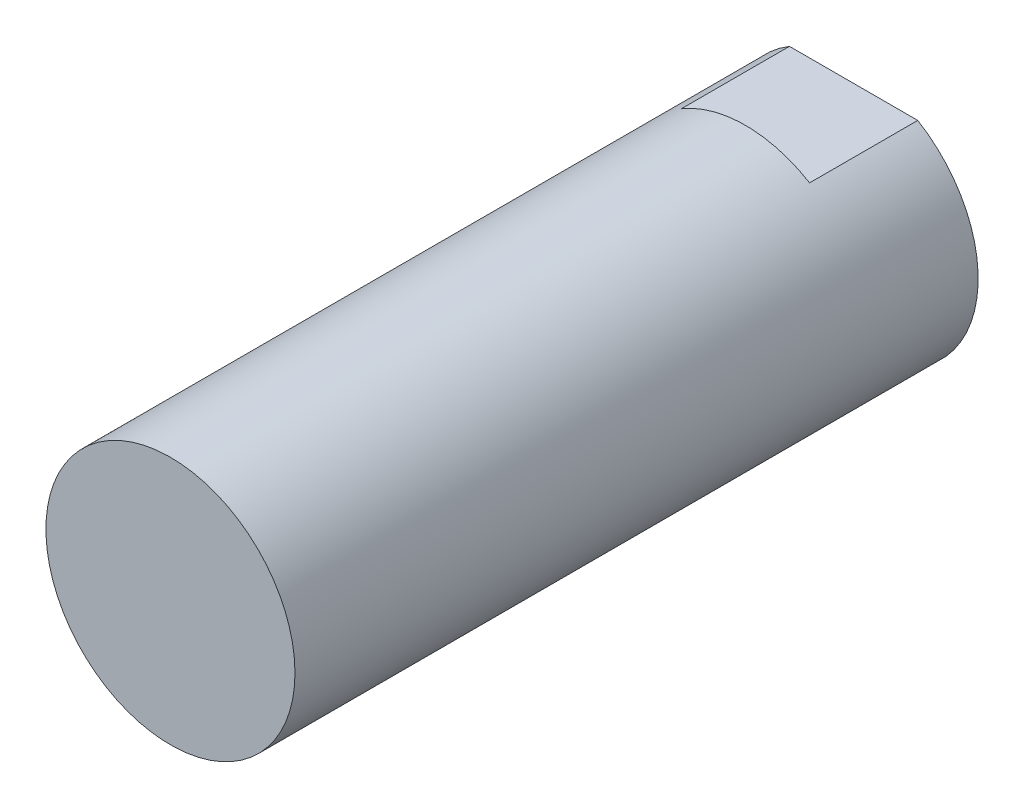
from build123d import *

# Parameters (mm, degrees)
SKETCH1_R          = 11.1125
EXTRUDE1_DEPTH     = 22.86
SKETCH2_R          = 5.55625
CUT_EXTRUDE1_DEPTH = 10.922
SKETCH3_R          = 3.96875
CUT_EXTRUDE2_DEPTH = 28.740852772
CHAMFER1_SIZE      = 1.016
CHAMFER1_SIZE2     = 1.75976362
SKETCH4_OUTSIDE_W  = 31.996
SKETCH4_OUTSIDE_H  = 31.996
CUT_EXTRUDE3_DEPTH = 9.652
SKETCH5_R          = 11.1125
EXTRUDE2_DEPTH     = 38.1


with BuildPart() as part:
    # Sketch1 → Extrude1 (new body)
    with BuildSketch(Plane.XY):
        Circle(SKETCH1_R)
    extrude(amount=EXTRUDE1_DEPTH)

    # Sketch2 → Cut-Extrude1 (cut)
    with BuildSketch(Plane.XY.offset(22.86)):
        Circle(SKETCH2_R)
    extrude(amount=-CUT_EXTRUDE1_DEPTH, mode=Mode.SUBTRACT)

    # Sketch3 → Cut-Extrude2 (cut, through all)
    with BuildSketch(Plane(origin=(0, 0, 0), x_dir=(-1, 0, 0), z_dir=(0, 0, -1))):
        Circle(SKETCH3_R)
    extrude(amount=-CUT_EXTRUDE2_DEPTH, mode=Mode.SUBTRACT)

    # Chamfer1
    chamfer1_edges = [part.edges().sort_by_distance(p)[0] for p in [
        (-5.55625, 0, 22.86),
    ]]
    chamfer1_side = [part.faces().sort_by_distance(p)[0] for p in [
        (-10.798191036, 0, 22.86),
    ]]
    chamfer(chamfer1_edges, length=CHAMFER1_SIZE, length2=CHAMFER1_SIZE2, reference=chamfer1_side[0])

    # Sketch4 outside → Cut-Extrude3 (cut)
    with BuildSketch(Plane(origin=(0, 0, 0), x_dir=(-1, 0, 0), z_dir=(0, 0, -1))):
        Rectangle(SKETCH4_OUTSIDE_W, SKETCH4_OUTSIDE_H)
        Polygon((0, 9.525), (13.423682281, 9.525), (13.423682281, -9.525), (-12.27961845, -9.525), (-12.27961845, 9.525), align=None, mode=Mode.SUBTRACT)
    extrude(amount=-CUT_EXTRUDE3_DEPTH, mode=Mode.SUBTRACT)

    # Sketch5 → Extrude2 (add)
    with BuildSketch(Plane.XY.offset(22.86)):
        with Locations(Location((0, 0, 0), (0, 0, 121.002719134))):
            Circle(SKETCH5_R)
    extrude(amount=EXTRUDE2_DEPTH)


solid = part.part
